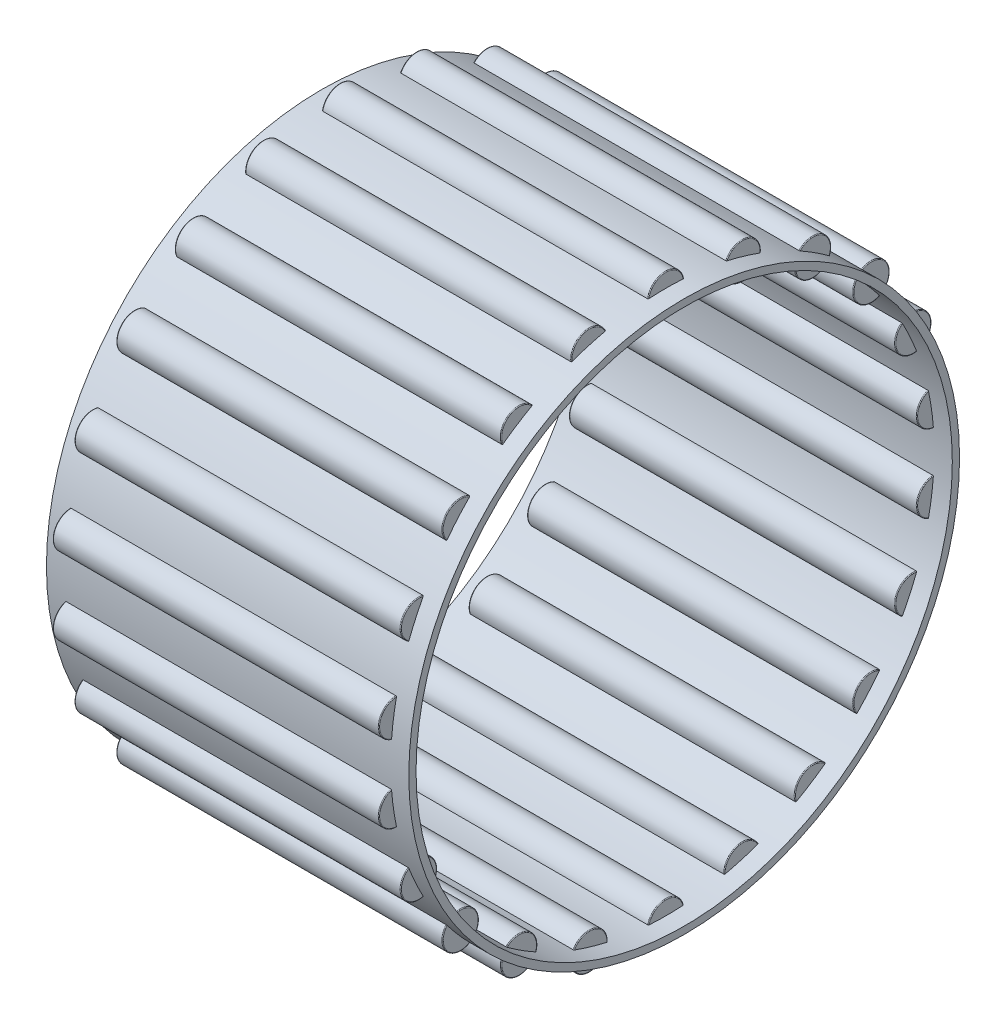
from build123d import *

# Parameters (mm, degrees)
CAGSPISKE_W           = 31.75
CAGSPISKE_H           = 0.635
ROLLERSDETAILED_COUNT = 22
ROLLERSDETAILED_ANGLE = 343.636363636


with BuildPart() as part:
    # CagSpiSke → CageSpine (revolve)
    with BuildSketch(Plane.XY, mode=Mode.PRIVATE) as cagespine_sk:
        with Locations((0, 23.8125)):
            Rectangle(CAGSPISKE_W, CAGSPISKE_H)
    revolve(cagespine_sk.sketch.rotate(Axis((-12.7, 0, 0), (1, 0, 0)), 270), axis=Axis((-12.7, 0, 0), (1, 0, 0)))

    # RolDetSke → RollerDetailed (revolve)
    with BuildSketch(Plane.XY):
        with BuildLine():
            Line((-14.224, 25.4), (14.224, 25.4))
            ThreePointArc((14.224, 25.4), (14.268901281, 25.381401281), (14.2875, 25.3365))
            Line((14.2875, 25.3365), (14.2875, 23.8125))
            Line((14.2875, 23.8125), (-14.2875, 23.8125))
            Line((-14.2875, 23.8125), (-14.2875, 25.3365))
            ThreePointArc((-14.2875, 25.3365), (-14.268901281, 25.381401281), (-14.224, 25.4))
        make_face()
    rollerdetailed = revolve(axis=Axis((-17.78, 23.8125, 0), (1, 0, 0)))

    # RollersDetailed: RollerDetailed ×22 about axis
    rollersdetailed_axis = Axis((-50, 0, 0), (1, 0, 0))
    for i in range(1, ROLLERSDETAILED_COUNT):
        add(rollerdetailed.rotate(rollersdetailed_axis, i * ROLLERSDETAILED_ANGLE / (ROLLERSDETAILED_COUNT - 1)))


solid = part.part
